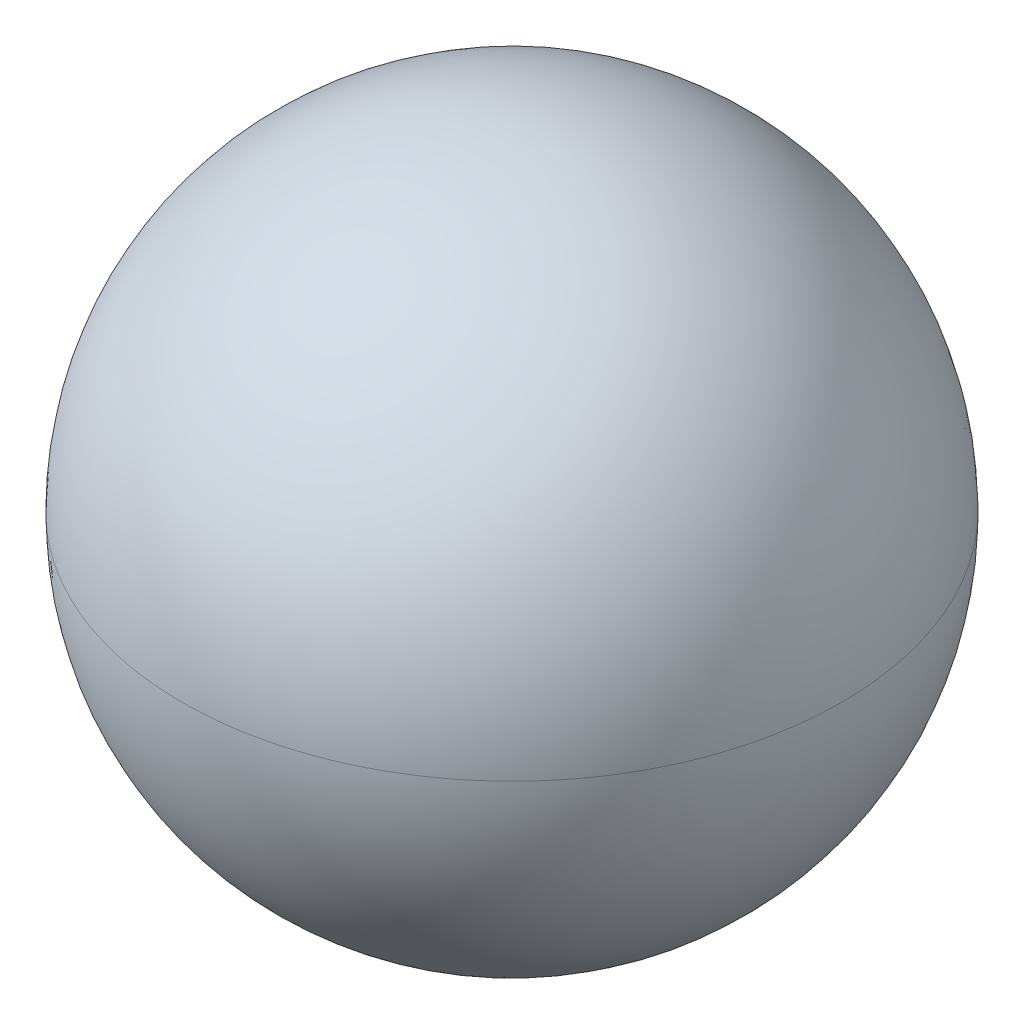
ISO-10303-21;
HEADER;
FILE_DESCRIPTION(('STEP AP214'),'2;1');
FILE_NAME('part.step','',(''),(''),'','','');
FILE_SCHEMA(('AUTOMOTIVE_DESIGN { 1 0 10303 214 1 1 1 1 }'));
ENDSEC;
DATA;
#1=APPLICATION_CONTEXT('core data for automotive mechanical design processes');
#2=APPLICATION_PROTOCOL_DEFINITION('international standard','automotive_design',2000,#1);
#3=PRODUCT_CONTEXT('',#1,'mechanical');
#4=PRODUCT('Part','Part','',(#3));
#5=PRODUCT_RELATED_PRODUCT_CATEGORY('part','',(#4));
#6=PRODUCT_DEFINITION_FORMATION('','',#4);
#7=PRODUCT_DEFINITION_CONTEXT('part definition',#1,'design');
#8=PRODUCT_DEFINITION('design','',#6,#7);
#9=PRODUCT_DEFINITION_SHAPE('','',#8);
#10=(LENGTH_UNIT() NAMED_UNIT(*) SI_UNIT(.MILLI.,.METRE.));
#11=(NAMED_UNIT(*) PLANE_ANGLE_UNIT() SI_UNIT($,.RADIAN.));
#12=(NAMED_UNIT(*) SI_UNIT($,.STERADIAN.) SOLID_ANGLE_UNIT());
#13=UNCERTAINTY_MEASURE_WITH_UNIT(LENGTH_MEASURE(1.E-05),#10,'distance_accuracy_value','');
#14=(GEOMETRIC_REPRESENTATION_CONTEXT(3) GLOBAL_UNCERTAINTY_ASSIGNED_CONTEXT((#13)) GLOBAL_UNIT_ASSIGNED_CONTEXT((#10,
#11,#12)) REPRESENTATION_CONTEXT('',''));
#15=CARTESIAN_POINT('',(0.,0.,0.));
#16=DIRECTION('',(0.,0.,1.));
#17=DIRECTION('',(1.,0.,0.));
#18=AXIS2_PLACEMENT_3D('',#15,#16,#17);
#19=CARTESIAN_POINT('',(27.1526,35.179,15.113));
#20=DIRECTION('',(0.578595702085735,0.267828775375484,0.77038611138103));
#21=DIRECTION('',(0.716495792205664,0.284388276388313,-0.636990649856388));
#22=AXIS2_PLACEMENT_3D('',#19,#20,#21);
#23=SPHERICAL_SURFACE('',#22,4.4958);
#24=CARTESIAN_POINT('',(24.5513494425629,33.9748953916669,11.6494981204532));
#25=VERTEX_POINT('',#24);
#26=VERTEX_LOOP('',#25);
#27=FACE_BOUND('',#26,.T.);
#28=CARTESIAN_POINT('',(27.1526,35.179,10.6172));
#29=CARTESIAN_POINT('',(27.0752868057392,35.1790108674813,10.6171983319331));
#30=CARTESIAN_POINT('',(26.9979751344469,35.1790450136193,10.6191943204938));
#31=CARTESIAN_POINT('',(26.8481133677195,35.1791033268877,10.6269332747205));
#32=CARTESIAN_POINT('',(26.7755514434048,35.1791279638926,10.6324482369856));
#33=CARTESIAN_POINT('',(26.6353101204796,35.1791244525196,10.6465382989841));
#34=CARTESIAN_POINT('',(26.567609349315,35.1790995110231,10.6549002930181));
#35=CARTESIAN_POINT('',(26.4447703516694,35.1790311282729,10.6729181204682));
#36=CARTESIAN_POINT('',(26.3895575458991,35.1789918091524,10.6820726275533));
#37=CARTESIAN_POINT('',(26.2430484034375,35.1790136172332,10.7091850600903));
#38=CARTESIAN_POINT('',(26.1520797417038,35.1791585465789,10.7289573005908));
#39=CARTESIAN_POINT('',(25.9874241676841,35.1793467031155,10.7701361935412));
#40=CARTESIAN_POINT('',(25.91351006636,35.1794033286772,10.7906447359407));
#41=CARTESIAN_POINT('',(25.7721352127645,35.1793430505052,10.8337952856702));
#42=CARTESIAN_POINT('',(25.7045947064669,35.1792384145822,10.8561752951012));
#43=CARTESIAN_POINT('',(25.5907021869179,35.1790798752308,10.8969381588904));
#44=CARTESIAN_POINT('',(25.5440588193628,35.1790201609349,10.9145125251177));
#45=CARTESIAN_POINT('',(25.4478847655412,35.1789783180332,10.9525870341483));
#46=CARTESIAN_POINT('',(25.3984017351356,35.1790023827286,10.9732078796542));
#47=CARTESIAN_POINT('',(25.3023399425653,35.1789962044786,11.0152708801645));
#48=CARTESIAN_POINT('',(25.2557284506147,35.1789682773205,11.036638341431));
#49=CARTESIAN_POINT('',(25.1738617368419,35.1789019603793,11.0758755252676));
#50=CARTESIAN_POINT('',(25.1384524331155,35.178867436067,11.0934243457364));
#51=CARTESIAN_POINT('',(25.0691184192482,35.1788043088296,11.1289322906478));
#52=CARTESIAN_POINT('',(25.0351802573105,35.1787755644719,11.1468652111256));
#53=CARTESIAN_POINT('',(24.9361978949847,35.1787405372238,11.2008005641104));
#54=CARTESIAN_POINT('',(24.8717957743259,35.1787805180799,11.237993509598));
#55=CARTESIAN_POINT('',(24.7693541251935,35.1789366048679,11.3005930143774));
#56=CARTESIAN_POINT('',(24.7307131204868,35.1790174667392,11.3250228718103));
#57=CARTESIAN_POINT('',(24.6671281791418,35.1789884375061,11.3665932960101));
#58=CARTESIAN_POINT('',(24.6419694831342,35.1789337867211,11.3834064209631));
#59=CARTESIAN_POINT('',(24.5517575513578,35.17876378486,11.4450205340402));
#60=CARTESIAN_POINT('',(24.4876975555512,35.17869239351,11.4912945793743));
#61=CARTESIAN_POINT('',(24.3891577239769,35.1788655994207,11.5665048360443));
#62=CARTESIAN_POINT('',(24.3538188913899,35.1789873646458,11.5943263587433));
#63=CARTESIAN_POINT('',(24.2920889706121,35.1790097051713,11.6444430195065));
#64=CARTESIAN_POINT('',(24.2655233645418,35.1789550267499,11.6665235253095));
#65=CARTESIAN_POINT('',(24.1786719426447,35.178842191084,11.740421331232));
#66=CARTESIAN_POINT('',(24.119487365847,35.1788720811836,11.7935478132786));
#67=CARTESIAN_POINT('',(24.0319792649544,35.1789446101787,11.8763927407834));
#68=CARTESIAN_POINT('',(24.0025859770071,35.1789740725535,11.9049926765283));
#69=CARTESIAN_POINT('',(23.9484301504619,35.1790224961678,11.9591485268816));
#70=CARTESIAN_POINT('',(23.9235695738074,35.1790423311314,11.9846063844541));
#71=CARTESIAN_POINT('',(23.8476586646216,35.1791721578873,12.0642105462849));
#72=CARTESIAN_POINT('',(23.797636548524,35.1793569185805,12.1193442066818));
#73=CARTESIAN_POINT('',(23.6969293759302,35.1795627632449,12.2360373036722));
#74=CARTESIAN_POINT('',(23.6464509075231,35.179571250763,12.297774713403));
#75=CARTESIAN_POINT('',(23.5451518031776,35.1793940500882,12.4286217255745));
#76=CARTESIAN_POINT('',(23.4945941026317,35.179193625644,12.4979357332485));
#77=CARTESIAN_POINT('',(23.4269397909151,35.1790343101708,12.5964912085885));
#78=CARTESIAN_POINT('',(23.4081283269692,35.179002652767,12.6245684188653));
#79=CARTESIAN_POINT('',(23.366175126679,35.1789966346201,12.6887388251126));
#80=CARTESIAN_POINT('',(23.3432276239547,35.1790399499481,12.7249592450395));
#81=CARTESIAN_POINT('',(23.2824564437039,35.1791650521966,12.8239870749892));
#82=CARTESIAN_POINT('',(23.2456363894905,35.1792523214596,12.8874155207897));
#83=CARTESIAN_POINT('',(23.191706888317,35.1793049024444,12.985782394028));
#84=CARTESIAN_POINT('',(23.173464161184,35.1793082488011,13.0201057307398));
#85=CARTESIAN_POINT('',(23.1371939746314,35.1792894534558,13.0905361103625));
#86=CARTESIAN_POINT('',(23.1192014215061,35.1792663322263,13.1266611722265));
#87=CARTESIAN_POINT('',(23.0789105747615,35.1791932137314,13.21036172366));
#88=CARTESIAN_POINT('',(23.0569524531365,35.1791372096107,13.2581012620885));
#89=CARTESIAN_POINT('',(23.0137863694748,35.1790427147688,13.3564551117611));
#90=CARTESIAN_POINT('',(22.9926548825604,35.1790051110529,13.4071030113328));
#91=CARTESIAN_POINT('',(22.9538026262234,35.1789952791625,13.5052416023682));
#92=CARTESIAN_POINT('',(22.9359446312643,35.179018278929,13.5526781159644));
#93=CARTESIAN_POINT('',(22.894759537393,35.1790687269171,13.667954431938));
#94=CARTESIAN_POINT('',(22.872241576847,35.1790940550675,13.7360853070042));
#95=CARTESIAN_POINT('',(22.8291039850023,35.1791077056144,13.8779073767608));
#96=CARTESIAN_POINT('',(22.8087101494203,35.1790934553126,13.9516670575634));
#97=CARTESIAN_POINT('',(22.7680198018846,35.1790429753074,14.1149549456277));
#98=CARTESIAN_POINT('',(22.7485548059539,35.1790029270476,14.2046926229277));
#99=CARTESIAN_POINT('',(22.7214860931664,35.1789981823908,14.3509655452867));
#100=CARTESIAN_POINT('',(22.7121830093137,35.1790106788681,14.4071934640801));
#101=CARTESIAN_POINT('',(22.6940358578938,35.1790327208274,14.5315066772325));
#102=CARTESIAN_POINT('',(22.6856753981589,35.1790411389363,14.5996635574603));
#103=CARTESIAN_POINT('',(22.6717121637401,35.1790455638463,14.7400309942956));
#104=CARTESIAN_POINT('',(22.6662856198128,35.1790408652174,14.8122590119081));
#105=CARTESIAN_POINT('',(22.6587364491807,35.1790102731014,14.9606527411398));
#106=CARTESIAN_POINT('',(22.6568001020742,35.1789832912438,15.0368280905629));
#107=CARTESIAN_POINT('',(22.6567999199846,35.1790130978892,15.172710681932));
#108=CARTESIAN_POINT('',(22.6579896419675,35.1790530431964,15.2324192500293));
#109=CARTESIAN_POINT('',(22.6629017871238,35.1791750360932,15.3556375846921));
#110=CARTESIAN_POINT('',(22.6667844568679,35.1792596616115,15.4191410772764));
#111=CARTESIAN_POINT('',(22.6775619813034,35.1794125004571,15.549818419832));
#112=CARTESIAN_POINT('',(22.6846271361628,35.1794793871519,15.6169782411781));
#113=CARTESIAN_POINT('',(22.7022715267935,35.1795728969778,15.7547904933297));
#114=CARTESIAN_POINT('',(22.7130305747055,35.1795969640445,15.8254199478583));
#115=CARTESIAN_POINT('',(22.7385826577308,35.1795929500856,15.9699384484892));
#116=CARTESIAN_POINT('',(22.7535643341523,35.1795619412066,16.0437941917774));
#117=CARTESIAN_POINT('',(22.7880932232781,35.1794579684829,16.1944703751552));
#118=CARTESIAN_POINT('',(22.8078370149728,35.1793829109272,16.271245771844));
#119=CARTESIAN_POINT('',(22.8524286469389,35.1792227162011,16.4274037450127));
#120=CARTESIAN_POINT('',(22.8774800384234,35.1791372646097,16.5067283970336));
#121=CARTESIAN_POINT('',(22.9259706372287,35.1790315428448,16.6466356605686));
#122=CARTESIAN_POINT('',(22.9485595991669,35.1790010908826,16.707515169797));
#123=CARTESIAN_POINT('',(23.003171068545,35.1789985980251,16.8454598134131));
#124=CARTESIAN_POINT('',(23.0360467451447,35.1790456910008,16.9221896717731));
#125=CARTESIAN_POINT('',(23.1031120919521,35.1790986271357,17.0674109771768));
#126=CARTESIAN_POINT('',(23.136966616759,35.1791075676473,17.1360578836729));
#127=CARTESIAN_POINT('',(23.212176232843,35.1790858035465,17.2792260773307));
#128=CARTESIAN_POINT('',(23.2539465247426,35.1790504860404,17.3535302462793));
#129=CARTESIAN_POINT('',(23.3274627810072,35.1790195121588,17.4760211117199));
#130=CARTESIAN_POINT('',(23.3580849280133,35.1790147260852,17.5248867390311));
#131=CARTESIAN_POINT('',(23.419369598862,35.1789861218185,17.6186258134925));
#132=CARTESIAN_POINT('',(23.4499282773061,35.1789634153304,17.6635671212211));
#133=CARTESIAN_POINT('',(23.518416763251,35.1788686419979,17.7604641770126));
#134=CARTESIAN_POINT('',(23.5566695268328,35.1787882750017,17.8121921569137));
#135=CARTESIAN_POINT('',(23.6296695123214,35.1786584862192,17.9066008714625));
#136=CARTESIAN_POINT('',(23.664124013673,35.1786062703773,17.949508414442));
#137=CARTESIAN_POINT('',(23.7286280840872,35.1785552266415,18.0268846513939));
#138=CARTESIAN_POINT('',(23.7584375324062,35.1785488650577,18.0615536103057));
#139=CARTESIAN_POINT('',(23.8129277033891,35.1785802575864,18.1230054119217));
#140=CARTESIAN_POINT('',(23.8374179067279,35.178609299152,18.1499575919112));
#141=CARTESIAN_POINT('',(23.8928521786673,35.1787348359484,18.2094948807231));
#142=CARTESIAN_POINT('',(23.9239657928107,35.1788455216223,18.2419227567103));
#143=CARTESIAN_POINT('',(23.9615503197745,35.1789666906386,18.2799373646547));
#144=CARTESIAN_POINT('',(23.9675612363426,35.1789856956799,18.2859825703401));
#145=CARTESIAN_POINT('',(24.0057450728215,35.1790763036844,18.3241664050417));
#146=CARTESIAN_POINT('',(24.0383896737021,35.1790188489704,18.3558353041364));
#147=CARTESIAN_POINT('',(24.1341365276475,35.1789160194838,18.4459401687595));
#148=CARTESIAN_POINT('',(24.1984619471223,35.1789270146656,18.5030856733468));
#149=CARTESIAN_POINT('',(24.3252175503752,35.1789299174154,18.6093455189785));
#150=CARTESIAN_POINT('',(24.3874140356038,35.178923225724,18.658739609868));
#151=CARTESIAN_POINT('',(24.5090611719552,35.1789483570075,18.7501992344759));
#152=CARTESIAN_POINT('',(24.5683100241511,35.1789770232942,18.7925326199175));
#153=CARTESIAN_POINT('',(24.649726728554,35.1789960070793,18.8477688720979));
#154=CARTESIAN_POINT('',(24.6710305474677,35.1789991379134,18.8619579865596));
#155=CARTESIAN_POINT('',(24.7371930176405,35.179001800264,18.9052135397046));
#156=CARTESIAN_POINT('',(24.7824550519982,35.178993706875,18.9336660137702));
#157=CARTESIAN_POINT('',(24.8982608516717,35.1789724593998,19.0036128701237));
#158=CARTESIAN_POINT('',(24.9694697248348,35.1789588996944,19.0440120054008));
#159=CARTESIAN_POINT('',(25.1099705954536,35.1789475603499,19.1187282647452));
#160=CARTESIAN_POINT('',(25.179149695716,35.1789489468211,19.1532584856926));
#161=CARTESIAN_POINT('',(25.3309233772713,35.1789791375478,19.2241860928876));
#162=CARTESIAN_POINT('',(25.4138256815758,35.1790124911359,19.2599289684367));
#163=CARTESIAN_POINT('',(25.5582220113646,35.1789909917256,19.3170947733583));
#164=CARTESIAN_POINT('',(25.6192400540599,35.1789581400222,19.3397316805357));
#165=CARTESIAN_POINT('',(25.7594305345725,35.1788272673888,19.3883049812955));
#166=CARTESIAN_POINT('',(25.8389005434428,35.1787135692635,19.4133894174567));
#167=CARTESIAN_POINT('',(25.9952981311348,35.1784989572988,19.4580161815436));
#168=CARTESIAN_POINT('',(26.0721669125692,35.1783976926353,19.4777653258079));
#169=CARTESIAN_POINT('',(26.2229741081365,35.1782529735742,19.5122832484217));
#170=CARTESIAN_POINT('',(26.2968668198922,35.1782068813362,19.5272517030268));
#171=CARTESIAN_POINT('',(26.4414008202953,35.1781926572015,19.5527647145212));
#172=CARTESIAN_POINT('',(26.5120083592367,35.1782205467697,19.5635007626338));
#173=CARTESIAN_POINT('',(26.649718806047,35.1783407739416,19.5810952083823));
#174=CARTESIAN_POINT('',(26.7167984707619,35.178429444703,19.5881359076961));
#175=CARTESIAN_POINT('',(26.8472619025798,35.1786360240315,19.5988683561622));
#176=CARTESIAN_POINT('',(26.9106315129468,35.1787519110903,19.6027324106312));
#177=CARTESIAN_POINT('',(27.0335375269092,35.1789245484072,19.6076174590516));
#178=CARTESIAN_POINT('',(27.093067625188,35.1789845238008,19.6088000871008));
#179=CARTESIAN_POINT('',(27.2299047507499,35.1790200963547,19.6087998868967));
#180=CARTESIAN_POINT('',(27.3072133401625,35.1789651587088,19.6068054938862));
#181=CARTESIAN_POINT('',(27.457069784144,35.1788926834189,19.5990683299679));
#182=CARTESIAN_POINT('',(27.5296296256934,35.1788731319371,19.5935534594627));
#183=CARTESIAN_POINT('',(27.6698712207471,35.1788792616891,19.5794637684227));
#184=CARTESIAN_POINT('',(27.7375742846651,35.1789021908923,19.5711018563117));
#185=CARTESIAN_POINT('',(27.8604202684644,35.1789689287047,19.5530834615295));
#186=CARTESIAN_POINT('',(27.9156377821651,35.179008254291,19.5439282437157));
#187=CARTESIAN_POINT('',(28.0621515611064,35.1789862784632,19.5168149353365));
#188=CARTESIAN_POINT('',(28.1531201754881,35.178841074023,19.4970427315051));
#189=CARTESIAN_POINT('',(28.3177759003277,35.1786536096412,19.4558637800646));
#190=CARTESIAN_POINT('',(28.3916901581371,35.1785977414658,19.4353551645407));
#191=CARTESIAN_POINT('',(28.5330645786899,35.1786559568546,19.3922048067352));
#192=CARTESIAN_POINT('',(28.6006045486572,35.1787580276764,19.3698250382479));
#193=CARTESIAN_POINT('',(28.7144983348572,35.1789226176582,19.329061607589));
#194=CARTESIAN_POINT('',(28.7611428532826,35.1789878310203,19.3114867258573));
#195=CARTESIAN_POINT('',(28.8276870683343,35.1790053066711,19.2851425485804));
#196=CARTESIAN_POINT('',(28.8478355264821,35.1790005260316,19.2769965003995));
#197=CARTESIAN_POINT('',(28.9447625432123,35.17898793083,19.2369883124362));
#198=CARTESIAN_POINT('',(29.0207338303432,35.179009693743,19.203134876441));
#199=CARTESIAN_POINT('',(29.1659525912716,35.1791249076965,19.1335346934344));
#200=CARTESIAN_POINT('',(29.2353222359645,35.1792137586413,19.0980413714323));
#201=CARTESIAN_POINT('',(29.3690052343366,35.1792579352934,19.0251977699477));
#202=CARTESIAN_POINT('',(29.433404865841,35.1792191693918,18.9880061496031));
#203=CARTESIAN_POINT('',(29.5358454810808,35.1790635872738,18.9254071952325));
#204=CARTESIAN_POINT('',(29.5744867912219,35.1789825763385,18.9009771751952));
#205=CARTESIAN_POINT('',(29.6380718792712,35.1790115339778,18.8594066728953));
#206=CARTESIAN_POINT('',(29.6632305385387,35.1790662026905,18.8425935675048));
#207=CARTESIAN_POINT('',(29.7534423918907,35.1792362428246,18.7809794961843));
#208=CARTESIAN_POINT('',(29.817502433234,35.1793076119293,18.7347054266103));
#209=CARTESIAN_POINT('',(29.9160422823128,35.1791343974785,18.6594951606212));
#210=CARTESIAN_POINT('',(29.9513811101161,35.1790126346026,18.6316736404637));
#211=CARTESIAN_POINT('',(30.0131110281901,35.1789902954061,18.5815569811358));
#212=CARTESIAN_POINT('',(30.0396766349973,35.1790449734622,18.5594764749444));
#213=CARTESIAN_POINT('',(30.1265280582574,35.1791578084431,18.4855786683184));
#214=CARTESIAN_POINT('',(30.1857126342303,35.1791279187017,18.4324521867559));
#215=CARTESIAN_POINT('',(30.273220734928,35.1790553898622,18.3496072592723));
#216=CARTESIAN_POINT('',(30.3026140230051,35.1790259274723,18.321007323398));
#217=CARTESIAN_POINT('',(30.3567698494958,35.17897750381,18.2668514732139));
#218=CARTESIAN_POINT('',(30.381630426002,35.1789576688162,18.2413936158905));
#219=CARTESIAN_POINT('',(30.4575413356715,35.1788278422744,18.1617894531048));
#220=CARTESIAN_POINT('',(30.5075634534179,35.1786430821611,18.1066557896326));
#221=CARTESIAN_POINT('',(30.6082706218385,35.1784372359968,17.989962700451));
#222=CARTESIAN_POINT('',(30.6587490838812,35.1784287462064,17.9282253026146));
#223=CARTESIAN_POINT('',(30.7600482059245,35.1786059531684,17.7973782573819));
#224=CARTESIAN_POINT('',(30.8106059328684,35.1788063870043,17.7280642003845));
#225=CARTESIAN_POINT('',(30.8782601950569,35.1789656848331,17.6295088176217));
#226=CARTESIAN_POINT('',(30.8970716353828,35.1789973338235,17.6014316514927));
#227=CARTESIAN_POINT('',(30.9390249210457,35.1790033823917,17.5372610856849));
#228=CARTESIAN_POINT('',(30.9619725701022,35.1789601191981,17.5010403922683));
#229=CARTESIAN_POINT('',(31.0227432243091,35.1788348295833,17.4020135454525));
#230=CARTESIAN_POINT('',(31.0595619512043,35.1787470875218,17.3385875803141));
#231=CARTESIAN_POINT('',(31.1328919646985,35.1786768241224,17.2048342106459));
#232=CARTESIAN_POINT('',(31.1691395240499,35.1787033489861,17.1343624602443));
#233=CARTESIAN_POINT('',(31.2404481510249,35.1788321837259,16.9862242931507));
#234=CARTESIAN_POINT('',(31.2752149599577,35.1789400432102,16.9084153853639));
#235=CARTESIAN_POINT('',(31.3162256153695,35.1789922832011,16.8091526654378));
#236=CARTESIAN_POINT('',(31.3245604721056,35.1789985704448,16.7885469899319));
#237=CARTESIAN_POINT('',(31.3513965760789,35.1790032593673,16.7207601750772));
#238=CARTESIAN_POINT('',(31.3692551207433,35.1789812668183,16.6733224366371));
#239=CARTESIAN_POINT('',(31.4104408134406,35.1789319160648,16.5580447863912));
#240=CARTESIAN_POINT('',(31.4329585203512,35.1789061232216,16.4899144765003));
#241=CARTESIAN_POINT('',(31.4760959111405,35.1788921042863,16.3480928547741));
#242=CARTESIAN_POINT('',(31.4964898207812,35.1789064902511,16.2743330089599));
#243=CARTESIAN_POINT('',(31.5371802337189,35.1789570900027,16.1110449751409));
#244=CARTESIAN_POINT('',(31.5566452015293,35.1789970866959,16.0213073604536));
#245=CARTESIAN_POINT('',(31.5837139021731,35.179001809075,15.8750344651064));
#246=CARTESIAN_POINT('',(31.5930169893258,35.1789893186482,15.818806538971));
#247=CARTESIAN_POINT('',(31.6111641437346,35.1789672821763,15.6944933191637));
#248=CARTESIAN_POINT('',(31.6195246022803,35.1789588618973,15.6263364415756));
#249=CARTESIAN_POINT('',(31.6334878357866,35.1789544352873,15.4859690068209));
#250=CARTESIAN_POINT('',(31.6389143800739,35.1789591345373,15.4137409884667));
#251=CARTESIAN_POINT('',(31.6464635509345,35.1789897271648,15.2653472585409));
#252=CARTESIAN_POINT('',(31.6483998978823,35.1790167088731,15.1891719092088));
#253=CARTESIAN_POINT('',(31.6484000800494,35.1789869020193,15.0532893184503));
#254=CARTESIAN_POINT('',(31.6472103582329,35.1789469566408,14.9935807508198));
#255=CARTESIAN_POINT('',(31.6422982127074,35.1788249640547,14.8703624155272));
#256=CARTESIAN_POINT('',(31.6384155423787,35.1787403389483,14.8068589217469));
#257=CARTESIAN_POINT('',(31.627638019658,35.1785874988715,14.6761815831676));
#258=CARTESIAN_POINT('',(31.6205728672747,35.178520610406,14.6090217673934));
#259=CARTESIAN_POINT('',(31.6029284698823,35.1784271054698,14.4712095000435));
#260=CARTESIAN_POINT('',(31.5921694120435,35.1784030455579,14.4005800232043));
#261=CARTESIAN_POINT('',(31.5666173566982,35.1784070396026,14.2560615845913));
#262=CARTESIAN_POINT('',(31.5516357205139,35.1784380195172,14.1822059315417));
#263=CARTESIAN_POINT('',(31.5171067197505,35.1785420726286,14.0315294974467));
#264=CARTESIAN_POINT('',(31.4973627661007,35.1786172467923,13.9547537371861));
#265=CARTESIAN_POINT('',(31.4527715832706,35.1787771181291,13.7985967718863));
#266=CARTESIAN_POINT('',(31.4277208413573,35.1788621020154,13.719273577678));
#267=CARTESIAN_POINT('',(31.379228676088,35.1789689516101,13.5793627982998));
#268=CARTESIAN_POINT('',(31.3566380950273,35.1790005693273,13.5184796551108));
#269=CARTESIAN_POINT('',(31.3269986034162,35.1789998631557,13.443611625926));
#270=CARTESIAN_POINT('',(31.3211795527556,35.1789978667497,13.4291336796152));
#271=CARTESIAN_POINT('',(31.2896610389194,35.178981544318,13.351879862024));
#272=CARTESIAN_POINT('',(31.2626122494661,35.1789483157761,13.2896464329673));
#273=CARTESIAN_POINT('',(31.2020881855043,35.1789023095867,13.1585898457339));
#274=CARTESIAN_POINT('',(31.1682334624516,35.1788926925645,13.0899423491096));
#275=CARTESIAN_POINT('',(31.093023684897,35.1789139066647,12.9467736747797));
#276=CARTESIAN_POINT('',(31.0512534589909,35.1789494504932,12.8724697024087));
#277=CARTESIAN_POINT('',(30.9777372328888,35.1789805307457,12.7499789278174));
#278=CARTESIAN_POINT('',(30.947115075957,35.1789852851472,12.7011132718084));
#279=CARTESIAN_POINT('',(30.8858303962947,35.1790138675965,12.6073741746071));
#280=CARTESIAN_POINT('',(30.8552717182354,35.1790365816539,12.5624328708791));
#281=CARTESIAN_POINT('',(30.786783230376,35.1791313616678,12.4655358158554));
#282=CARTESIAN_POINT('',(30.7485304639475,35.1792117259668,12.4138078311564));
#283=CARTESIAN_POINT('',(30.6755304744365,35.179341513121,12.3193991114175));
#284=CARTESIAN_POINT('',(30.6410759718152,35.1793937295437,12.2764915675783));
#285=CARTESIAN_POINT('',(30.5765718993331,35.1794447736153,12.1991153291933));
#286=CARTESIAN_POINT('',(30.5467624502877,35.1794511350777,12.1644463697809));
#287=CARTESIAN_POINT('',(30.4922722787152,35.1794197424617,12.1029945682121));
#288=CARTESIAN_POINT('',(30.467782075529,35.1793907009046,12.0760423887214));
#289=CARTESIAN_POINT('',(30.412347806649,35.1792651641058,12.0165051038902));
#290=CARTESIAN_POINT('',(30.3812341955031,35.1791544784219,11.9840772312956));
#291=CARTESIAN_POINT('',(30.343649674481,35.1790333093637,11.9460626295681));
#292=CARTESIAN_POINT('',(30.3376387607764,35.1790143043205,11.9400174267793));
#293=CARTESIAN_POINT('',(30.2994549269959,35.1789236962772,11.9018335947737));
#294=CARTESIAN_POINT('',(30.2668103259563,35.1789811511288,11.8701646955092));
#295=CARTESIAN_POINT('',(30.1710634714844,35.1790839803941,11.7800598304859));
#296=CARTESIAN_POINT('',(30.1067380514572,35.1790729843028,11.7229143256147));
#297=CARTESIAN_POINT('',(29.9799824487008,35.1790700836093,11.6166544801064));
#298=CARTESIAN_POINT('',(29.9177859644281,35.1790767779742,11.5672603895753));
#299=CARTESIAN_POINT('',(29.7961388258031,35.179051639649,11.4758007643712));
#300=CARTESIAN_POINT('',(29.7368899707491,35.1790229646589,11.4334673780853));
#301=CARTESIAN_POINT('',(29.6554732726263,35.1790039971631,11.3782311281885));
#302=CARTESIAN_POINT('',(29.6341694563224,35.1790008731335,11.3640420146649));
#303=CARTESIAN_POINT('',(29.5680069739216,35.1789981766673,11.3207864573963));
#304=CARTESIAN_POINT('',(29.5227449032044,35.179006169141,11.2923339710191));
#305=CARTESIAN_POINT('',(29.4069392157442,35.1790277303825,11.2223871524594));
#306=CARTESIAN_POINT('',(29.3357305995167,35.1790420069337,11.181988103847));
#307=CARTESIAN_POINT('',(29.1952290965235,35.1790515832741,11.1072716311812));
#308=CARTESIAN_POINT('',(29.1260491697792,35.1790478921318,11.0727411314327));
#309=CARTESIAN_POINT('',(28.9901095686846,35.1790269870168,11.0092128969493));
#310=CARTESIAN_POINT('',(28.9234464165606,35.1790105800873,10.9800093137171));
#311=CARTESIAN_POINT('',(28.8399468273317,35.1790010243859,10.9458206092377));
#312=CARTESIAN_POINT('',(28.8237324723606,35.1789996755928,10.9392918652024));
#313=CARTESIAN_POINT('',(28.7483855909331,35.1790011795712,10.9094628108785));
#314=CARTESIAN_POINT('',(28.6887896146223,35.1790244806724,10.8873190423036));
#315=CARTESIAN_POINT('',(28.5520096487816,35.1791010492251,10.8397727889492));
#316=CARTESIAN_POINT('',(28.4745445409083,35.1791608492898,10.8151772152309));
#317=CARTESIAN_POINT('',(28.3222494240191,35.1792579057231,10.7713294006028));
#318=CARTESIAN_POINT('',(28.2474779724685,35.1792961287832,10.7518734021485));
#319=CARTESIAN_POINT('',(28.1009393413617,35.1793253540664,10.717748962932));
#320=CARTESIAN_POINT('',(28.029217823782,35.1793187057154,10.7028843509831));
#321=CARTESIAN_POINT('',(27.8890809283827,35.1792632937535,10.6773935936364));
#322=CARTESIAN_POINT('',(27.8206995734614,35.1792168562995,10.6665799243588));
#323=CARTESIAN_POINT('',(27.6874755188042,35.179110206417,10.6486548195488));
#324=CARTESIAN_POINT('',(27.6226568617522,35.1790509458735,10.6413654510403));
#325=CARTESIAN_POINT('',(27.5276247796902,35.1790059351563,10.6327670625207));
#326=CARTESIAN_POINT('',(27.4975081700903,35.1789978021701,10.6303479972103));
#327=CARTESIAN_POINT('',(27.4307640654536,35.1789900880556,10.6256635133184));
#328=CARTESIAN_POINT('',(27.3941263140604,35.178992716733,10.6235424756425));
#329=CARTESIAN_POINT('',(27.2892286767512,35.1790044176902,10.6187573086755));
#330=CARTESIAN_POINT('',(27.2209166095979,35.1790170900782,10.6171993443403));
#331=CARTESIAN_POINT('',(27.1526,35.179,10.6172));
#332=B_SPLINE_CURVE_WITH_KNOTS('',3,(#28,#29,#30,#31,#32,#33,#34,#35,#36,#37,#38,#39,#40,#41,
#42,#43,#44,#45,#46,#47,#48,#49,#50,#51,#52,#53,#54,#55,#56,#57,#58,#59,#60,#61,#62,#63,#64,#65,
#66,#67,#68,#69,#70,#71,#72,#73,#74,#75,#76,#77,#78,#79,#80,#81,#82,#83,#84,#85,#86,#87,#88,#89,
#90,#91,#92,#93,#94,#95,#96,#97,#98,#99,#100,#101,#102,#103,#104,#105,#106,#107,#108,#109,#110,
#111,#112,#113,#114,#115,#116,#117,#118,#119,#120,#121,#122,#123,#124,#125,#126,#127,#128,#129,
#130,#131,#132,#133,#134,#135,#136,#137,#138,#139,#140,#141,#142,#143,#144,#145,#146,#147,#148,
#149,#150,#151,#152,#153,#154,#155,#156,#157,#158,#159,#160,#161,#162,#163,#164,#165,#166,#167,
#168,#169,#170,#171,#172,#173,#174,#175,#176,#177,#178,#179,#180,#181,#182,#183,#184,#185,#186,
#187,#188,#189,#190,#191,#192,#193,#194,#195,#196,#197,#198,#199,#200,#201,#202,#203,#204,#205,
#206,#207,#208,#209,#210,#211,#212,#213,#214,#215,#216,#217,#218,#219,#220,#221,#222,#223,#224,
#225,#226,#227,#228,#229,#230,#231,#232,#233,#234,#235,#236,#237,#238,#239,#240,#241,#242,#243,
#244,#245,#246,#247,#248,#249,#250,#251,#252,#253,#254,#255,#256,#257,#258,#259,#260,#261,#262,
#263,#264,#265,#266,#267,#268,#269,#270,#271,#272,#273,#274,#275,#276,#277,#278,#279,#280,#281,
#282,#283,#284,#285,#286,#287,#288,#289,#290,#291,#292,#293,#294,#295,#296,#297,#298,#299,#300,
#301,#302,#303,#304,#305,#306,#307,#308,#309,#310,#311,#312,#313,#314,#315,#316,#317,#318,#319,
#320,#321,#322,#323,#324,#325,#326,#327,#328,#329,#330,#331),.UNSPECIFIED.,.F.,.F.,(4,2,2,2,2,2,
2,2,2,2,2,2,2,2,2,2,2,2,2,2,2,2,2,2,2,2,2,2,2,2,2,2,2,2,2,2,2,2,2,2,2,2,2,2,2,2,2,2,2,2,2,2,2,2,
2,2,2,2,2,2,2,2,2,2,2,2,2,2,2,2,2,2,2,2,2,2,2,2,2,2,2,2,2,2,2,2,2,2,2,2,2,2,2,2,2,2,2,2,2,2,2,2,
2,2,2,2,2,2,2,2,2,2,2,2,2,2,2,2,2,2,2,2,2,2,2,2,2,2,2,2,2,2,2,2,2,2,2,2,2,2,2,2,2,2,2,2,2,2,2,2,
2,4),(0.,0.231910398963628,0.450139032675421,0.654710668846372,0.8225780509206,1.10165652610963,
1.33168253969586,1.54505312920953,1.6945613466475,1.85534913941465,2.00914592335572,
2.12769017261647,2.24283442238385,2.46583971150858,2.6029676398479,2.69374250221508,
2.93068606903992,3.06559757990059,3.16922263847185,3.40768222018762,3.53070351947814,
3.63744398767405,3.86067697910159,4.09981125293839,4.3570339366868,4.45841704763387,
4.58703471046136,4.80695545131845,4.92355545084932,5.04461410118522,5.20222347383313,
5.36682373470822,5.51885720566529,5.73403692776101,5.96352507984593,6.23880782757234,
6.40975020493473,6.61567761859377,6.83289001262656,7.0613863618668,7.24050321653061,
7.43131144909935,7.63383451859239,7.84808608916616,8.07407029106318,8.3117817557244,
8.56120552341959,8.75595690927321,9.00624651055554,9.23577673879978,9.49134762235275,
9.6643115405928,9.82731648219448,10.0202610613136,10.1853112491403,10.3224565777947,
10.4316979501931,10.5664946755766,10.5920697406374,10.728495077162,10.9864688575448,
11.2246352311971,11.4429951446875,11.5197825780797,11.680134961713,11.9256158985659,
12.1574749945,12.4281339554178,12.623325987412,12.8731942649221,13.1111809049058,
13.3372657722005,13.5514420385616,13.7537186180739,13.9441230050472,14.1227047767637,
14.3545990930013,14.5728230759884,14.7774011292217,14.9452828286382,15.2243613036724,
15.4543873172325,15.667757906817,15.8172661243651,15.882463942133,16.131834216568,
16.3655029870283,16.5885082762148,16.7256362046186,16.8164110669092,17.0533546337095,
17.1882661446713,17.291891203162,17.5303507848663,17.6533720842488,17.7601125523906,
17.9833455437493,18.2224798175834,18.4797025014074,18.5810856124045,18.7097032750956,
18.9296240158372,19.1672619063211,19.4227720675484,19.4894537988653,19.6414872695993,
19.8566669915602,20.0861551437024,20.3614378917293,20.5323802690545,20.7383076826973,
20.9555200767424,21.1840164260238,21.3631332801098,21.5539415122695,21.7564645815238,
21.9707161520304,22.196700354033,22.4344118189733,22.6838355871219,22.8785869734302,
22.9253976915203,23.1288913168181,23.3584215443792,23.6139924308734,23.7869563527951,
23.9499613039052,24.1429058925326,24.3079560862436,24.4451014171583,24.5543427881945,
24.6891394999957,24.7147145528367,24.8511398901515,25.109113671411,25.3472800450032,
25.5656399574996,25.6424273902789,25.8027797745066,26.0482607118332,26.2801198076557,
26.4983598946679,26.55079792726,26.7414668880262,26.9851728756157,27.2168549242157,
27.4365039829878,27.6441251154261,27.8397397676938,27.9303756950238,28.0404622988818,
28.2453829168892),.UNSPECIFIED.);
#333=CARTESIAN_POINT('',(27.1526,35.179,10.6172));
#334=VERTEX_POINT('',#333);
#335=EDGE_CURVE('E11',#334,#334,#332,.T.);
#336=ORIENTED_EDGE('',*,*,#335,.F.);
#337=EDGE_LOOP('',(#336));
#338=FACE_BOUND('',#337,.T.);
#339=ADVANCED_FACE('F17',(#27,#338),#23,.T.);
#340=CARTESIAN_POINT('',(27.1526,35.179,15.113));
#341=DIRECTION('',(0.578595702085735,0.267828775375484,0.77038611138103));
#342=DIRECTION('',(0.716495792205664,0.284388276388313,-0.636990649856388));
#343=AXIS2_PLACEMENT_3D('',#340,#341,#342);
#344=SPHERICAL_SURFACE('',#343,4.4958);
#345=CARTESIAN_POINT('',(29.753850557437,36.3831046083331,18.5765018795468));
#346=VERTEX_POINT('',#345);
#347=VERTEX_LOOP('',#346);
#348=FACE_BOUND('',#347,.T.);
#349=ORIENTED_EDGE('',*,*,#335,.T.);
#350=EDGE_LOOP('',(#349));
#351=FACE_BOUND('',#350,.T.);
#352=ADVANCED_FACE('F37',(#348,#351),#344,.T.);
#353=CLOSED_SHELL('',(#339,#352));
#354=MANIFOLD_SOLID_BREP('B1',#353);
#355=ADVANCED_BREP_SHAPE_REPRESENTATION('',(#18,#354),#14);
#356=SHAPE_DEFINITION_REPRESENTATION(#9,#355);
ENDSEC;
END-ISO-10303-21;
